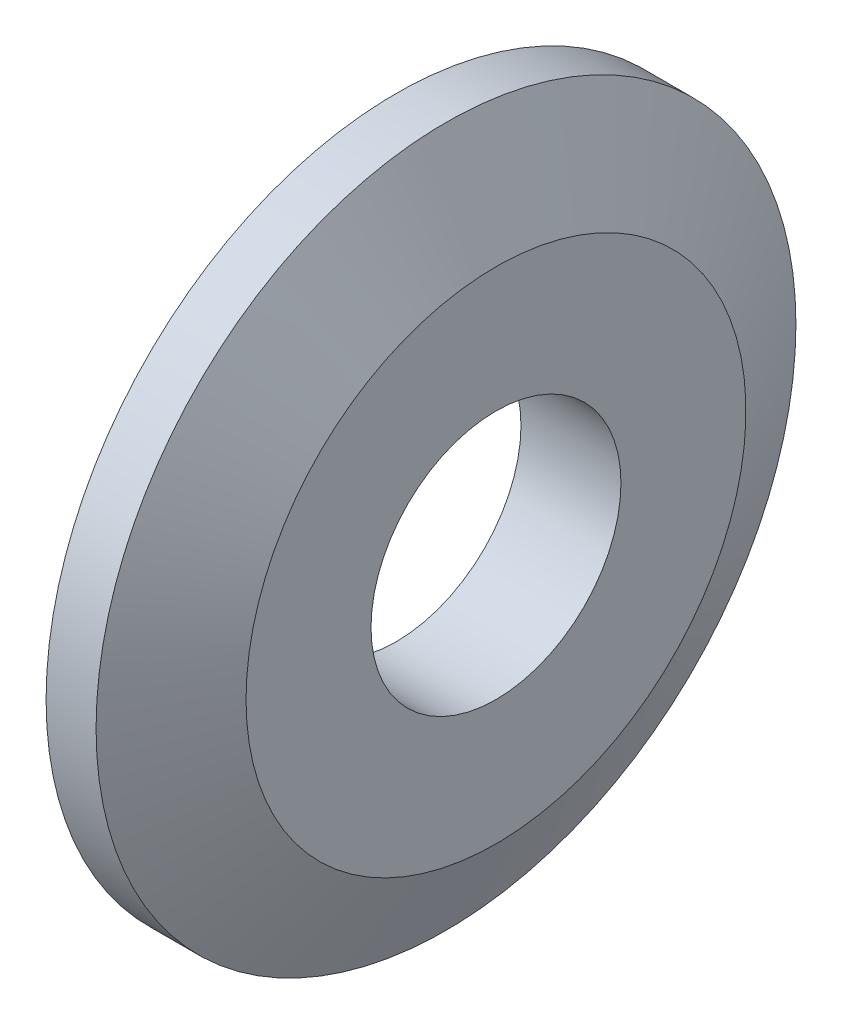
ISO-10303-21;
HEADER;
FILE_DESCRIPTION(('STEP AP214'),'2;1');
FILE_NAME('part.step','',(''),(''),'','','');
FILE_SCHEMA(('AUTOMOTIVE_DESIGN { 1 0 10303 214 1 1 1 1 }'));
ENDSEC;
DATA;
#1=APPLICATION_CONTEXT('core data for automotive mechanical design processes');
#2=APPLICATION_PROTOCOL_DEFINITION('international standard','automotive_design',2000,#1);
#3=PRODUCT_CONTEXT('',#1,'mechanical');
#4=PRODUCT('Part','Part','',(#3));
#5=PRODUCT_RELATED_PRODUCT_CATEGORY('part','',(#4));
#6=PRODUCT_DEFINITION_FORMATION('','',#4);
#7=PRODUCT_DEFINITION_CONTEXT('part definition',#1,'design');
#8=PRODUCT_DEFINITION('design','',#6,#7);
#9=PRODUCT_DEFINITION_SHAPE('','',#8);
#10=(LENGTH_UNIT() NAMED_UNIT(*) SI_UNIT(.MILLI.,.METRE.));
#11=(NAMED_UNIT(*) PLANE_ANGLE_UNIT() SI_UNIT($,.RADIAN.));
#12=(NAMED_UNIT(*) SI_UNIT($,.STERADIAN.) SOLID_ANGLE_UNIT());
#13=UNCERTAINTY_MEASURE_WITH_UNIT(LENGTH_MEASURE(1.E-05),#10,'distance_accuracy_value','');
#14=(GEOMETRIC_REPRESENTATION_CONTEXT(3) GLOBAL_UNCERTAINTY_ASSIGNED_CONTEXT((#13)) GLOBAL_UNIT_ASSIGNED_CONTEXT((#10,
#11,#12)) REPRESENTATION_CONTEXT('',''));
#15=CARTESIAN_POINT('',(0.,0.,0.));
#16=DIRECTION('',(0.,0.,1.));
#17=DIRECTION('',(1.,0.,0.));
#18=AXIS2_PLACEMENT_3D('',#15,#16,#17);
#19=CARTESIAN_POINT('',(0.,0.,0.));
#20=DIRECTION('',(-1.,0.,0.));
#21=DIRECTION('',(0.,0.,1.));
#22=AXIS2_PLACEMENT_3D('',#19,#20,#21);
#23=CYLINDRICAL_SURFACE('',#22,2.5);
#24=CARTESIAN_POINT('',(2.,0.,0.));
#25=DIRECTION('',(-1.,0.,0.));
#26=DIRECTION('',(0.,0.,1.));
#27=AXIS2_PLACEMENT_3D('',#24,#25,#26);
#28=CIRCLE('',#27,2.5);
#29=CARTESIAN_POINT('',(2.,0.,2.5));
#30=VERTEX_POINT('',#29);
#31=EDGE_CURVE('E50',#30,#30,#28,.T.);
#32=ORIENTED_EDGE('',*,*,#31,.F.);
#33=EDGE_LOOP('',(#32));
#34=FACE_BOUND('',#33,.T.);
#35=CARTESIAN_POINT('',(0.,0.,0.));
#36=DIRECTION('',(-1.,0.,0.));
#37=DIRECTION('',(0.,0.,1.));
#38=AXIS2_PLACEMENT_3D('',#35,#36,#37);
#39=CIRCLE('',#38,2.5);
#40=CARTESIAN_POINT('',(0.,0.,2.5));
#41=VERTEX_POINT('',#40);
#42=EDGE_CURVE('E10',#41,#41,#39,.T.);
#43=ORIENTED_EDGE('',*,*,#42,.T.);
#44=EDGE_LOOP('',(#43));
#45=FACE_BOUND('',#44,.T.);
#46=ADVANCED_FACE('F31',(#34,#45),#23,.F.);
#47=CARTESIAN_POINT('',(0.,2.5,0.));
#48=DIRECTION('',(1.,0.,0.));
#49=DIRECTION('',(0.,0.,-1.));
#50=AXIS2_PLACEMENT_3D('',#47,#48,#49);
#51=PLANE('',#50);
#52=ORIENTED_EDGE('',*,*,#42,.F.);
#53=EDGE_LOOP('',(#52));
#54=FACE_BOUND('',#53,.T.);
#55=CARTESIAN_POINT('',(0.,0.,0.));
#56=DIRECTION('',(-1.,0.,0.));
#57=DIRECTION('',(0.,0.,1.));
#58=AXIS2_PLACEMENT_3D('',#55,#56,#57);
#59=CIRCLE('',#58,7.);
#60=CARTESIAN_POINT('',(0.,0.,7.));
#61=VERTEX_POINT('',#60);
#62=EDGE_CURVE('E37',#61,#61,#59,.T.);
#63=ORIENTED_EDGE('',*,*,#62,.T.);
#64=EDGE_LOOP('',(#63));
#65=FACE_BOUND('',#64,.T.);
#66=ADVANCED_FACE('F57',(#54,#65),#51,.F.);
#67=CARTESIAN_POINT('',(0.,0.,0.));
#68=DIRECTION('',(-1.,0.,0.));
#69=DIRECTION('',(0.,0.,1.));
#70=AXIS2_PLACEMENT_3D('',#67,#68,#69);
#71=CYLINDRICAL_SURFACE('',#70,7.);
#72=ORIENTED_EDGE('',*,*,#62,.F.);
#73=EDGE_LOOP('',(#72));
#74=FACE_BOUND('',#73,.T.);
#75=CARTESIAN_POINT('',(1.,0.,0.));
#76=DIRECTION('',(-1.,0.,0.));
#77=DIRECTION('',(0.,0.,1.));
#78=AXIS2_PLACEMENT_3D('',#75,#76,#77);
#79=CIRCLE('',#78,7.);
#80=CARTESIAN_POINT('',(1.,0.,7.));
#81=VERTEX_POINT('',#80);
#82=EDGE_CURVE('E41',#81,#81,#79,.T.);
#83=ORIENTED_EDGE('',*,*,#82,.T.);
#84=EDGE_LOOP('',(#83));
#85=FACE_BOUND('',#84,.T.);
#86=ADVANCED_FACE('F61',(#74,#85),#71,.T.);
#87=CARTESIAN_POINT('',(2.,0.,0.));
#88=DIRECTION('',(-1.,0.,0.));
#89=DIRECTION('',(0.,0.,1.));
#90=AXIS2_PLACEMENT_3D('',#87,#88,#89);
#91=CONICAL_SURFACE('',#90,5.,1.10714871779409);
#92=ORIENTED_EDGE('',*,*,#82,.F.);
#93=EDGE_LOOP('',(#92));
#94=FACE_BOUND('',#93,.T.);
#95=CARTESIAN_POINT('',(2.,0.,0.));
#96=DIRECTION('',(-1.,0.,0.));
#97=DIRECTION('',(0.,0.,1.));
#98=AXIS2_PLACEMENT_3D('',#95,#96,#97);
#99=CIRCLE('',#98,5.);
#100=CARTESIAN_POINT('',(2.,0.,5.));
#101=VERTEX_POINT('',#100);
#102=EDGE_CURVE('E45',#101,#101,#99,.T.);
#103=ORIENTED_EDGE('',*,*,#102,.T.);
#104=EDGE_LOOP('',(#103));
#105=FACE_BOUND('',#104,.T.);
#106=ADVANCED_FACE('F66',(#94,#105),#91,.T.);
#107=CARTESIAN_POINT('',(2.,5.,0.));
#108=DIRECTION('',(-1.,0.,0.));
#109=DIRECTION('',(0.,0.,1.));
#110=AXIS2_PLACEMENT_3D('',#107,#108,#109);
#111=PLANE('',#110);
#112=ORIENTED_EDGE('',*,*,#102,.F.);
#113=EDGE_LOOP('',(#112));
#114=FACE_BOUND('',#113,.T.);
#115=ORIENTED_EDGE('',*,*,#31,.T.);
#116=EDGE_LOOP('',(#115));
#117=FACE_BOUND('',#116,.T.);
#118=ADVANCED_FACE('F54',(#114,#117),#111,.F.);
#119=CLOSED_SHELL('',(#46,#66,#86,#106,#118));
#120=MANIFOLD_SOLID_BREP('B2',#119);
#121=ADVANCED_BREP_SHAPE_REPRESENTATION('',(#18,#120),#14);
#122=SHAPE_DEFINITION_REPRESENTATION(#9,#121);
ENDSEC;
END-ISO-10303-21;
